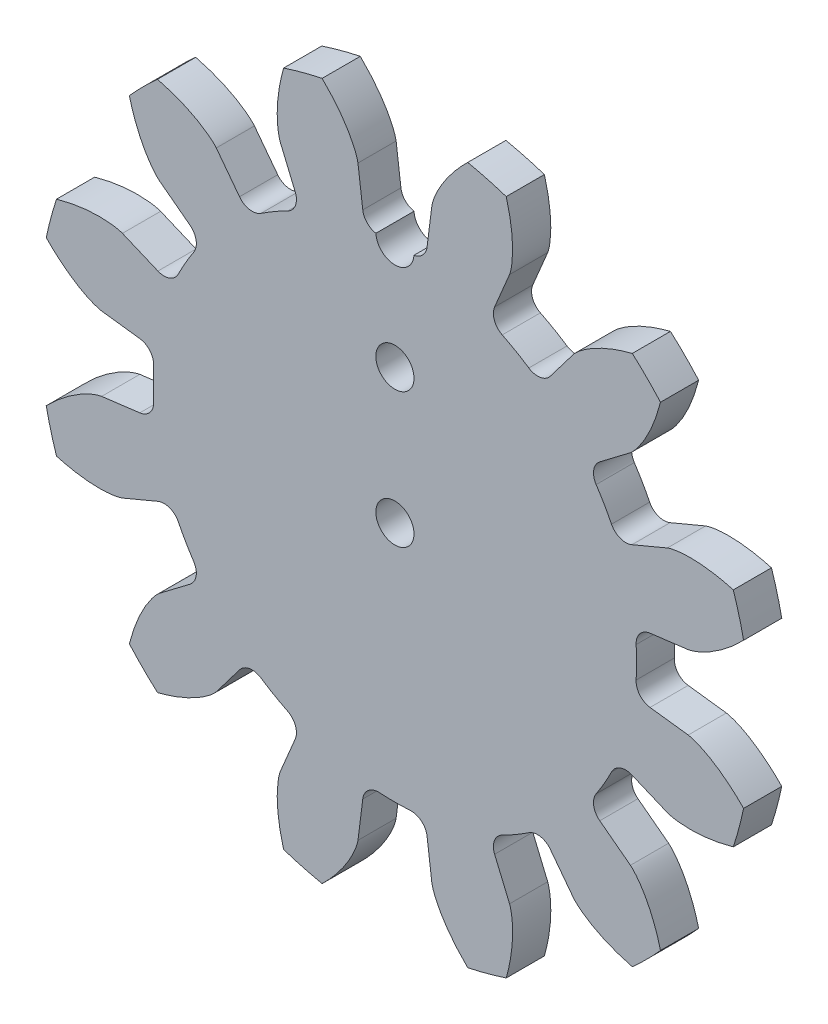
from build123d import *

# Parameters (mm, degrees)
BASECYLINDERSKETCH_R         = 29.633333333
BASECYLINDERSKETCH_R_2       = 1.5875
BASECYLINDER_DEPTH           = 3.175
TOOTH_DEPTH                  = 43.027961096
TOOTHGULLETFILLET_R          = 1.323318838
TEETH_COUNT                  = 12
TOOTHGULLETFILLET_OF_TEETH_R = 1.323318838
F_1_8_0_1250_DOWEL_HOLE1_D   = 3.175


with BuildPart() as part:
    # BaseCylinderSketch → BaseCylinder (new body)
    with BuildSketch(Plane.XY):
        Circle(BASECYLINDERSKETCH_R)
        Circle(BASECYLINDERSKETCH_R_2, mode=Mode.SUBTRACT)
    extrude(amount=BASECYLINDER_DEPTH)

    # InvoluteCurvesAndToothGulletSketch → Tooth (cut, symmetric)
    with BuildSketch(Plane.XY.offset(3.175)):
        with BuildLine():
            ThreePointArc((19.950550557, 2.51408073), (20.108333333, 0), (19.950550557, -2.51408073))
            Line((19.950550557, -2.51408073), (24.397993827, -3.074527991))
            add(Edge.make_bspline(
                [(24.397993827, -3.074527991), (24.406134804, -3.075671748), (24.428917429, -3.079238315), (24.471780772, -3.087396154), (24.541379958, -3.102709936), (24.62951992, -3.125157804), (24.742752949, -3.157528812), (24.875192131, -3.199963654), (25.019660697, -3.251083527), (25.175587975, -3.311514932), (25.329978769, -3.376042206), (25.482841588, -3.4443348), (25.634040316, -3.515890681), (25.815852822, -3.606708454), (26.031961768, -3.721349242), (26.281618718, -3.863637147), (26.561165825, -4.034742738), (26.841988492, -4.21941318), (27.114886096, -4.409544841), (27.386446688, -4.611195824), (27.646228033, -4.813063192), (27.911532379, -5.032358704), (28.154136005, -5.239686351), (28.420686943, -5.482446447), (28.634281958, -5.681431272), (28.850387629, -5.895603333), (28.954890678, -6.00110836), (29.00801009, -6.055559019)],
                knots=[0, 0, 0, 0, 0, 0.005376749, 0.015083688, 0.02853182, 0.04661014, 0.064854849, 0.092110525, 0.119476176, 0.146842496, 0.174208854, 0.201574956, 0.228941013, 0.256307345, 0.307035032, 0.361767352, 0.416499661, 0.471231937, 0.525964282, 0.580696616, 0.635428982, 0.690161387, 0.744893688, 0.799626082, 0.854358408, 0.909090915, 0.909090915, 0.909090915, 0.909090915, 0.909090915], degree=4))
            ThreePointArc((29.00801009, -6.055559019), (29.476587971, -3.043880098), (29.633333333, 0))
            ThreePointArc((29.633333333, 0), (29.476587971, 3.043880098), (29.00801009, 6.055559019))
            add(Edge.make_bspline(
                [(24.397993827, 3.074527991), (24.406134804, 3.075671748), (24.428917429, 3.079238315), (24.471780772, 3.087396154), (24.541379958, 3.102709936), (24.62951992, 3.125157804), (24.742752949, 3.157528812), (24.875192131, 3.199963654), (25.019660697, 3.251083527), (25.175587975, 3.311514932), (25.329978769, 3.376042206), (25.482841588, 3.4443348), (25.634040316, 3.515890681), (25.815852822, 3.606708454), (26.031961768, 3.721349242), (26.281618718, 3.863637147), (26.561165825, 4.034742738), (26.841988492, 4.21941318), (27.114886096, 4.409544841), (27.386446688, 4.611195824), (27.646228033, 4.813063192), (27.911532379, 5.032358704), (28.154136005, 5.239686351), (28.420686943, 5.482446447), (28.634281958, 5.681431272), (28.850387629, 5.895603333), (28.954890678, 6.00110836), (29.00801009, 6.055559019)],
                knots=[0, 0, 0, 0, 0, 0.005376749, 0.015083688, 0.02853182, 0.04661014, 0.064854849, 0.092110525, 0.119476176, 0.146842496, 0.174208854, 0.201574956, 0.228941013, 0.256307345, 0.307035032, 0.361767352, 0.416499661, 0.471231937, 0.525964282, 0.580696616, 0.635428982, 0.690161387, 0.744893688, 0.799626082, 0.854358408, 0.909090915, 0.909090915, 0.909090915, 0.909090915, 0.909090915], degree=4))
            Line((24.397993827, 3.074527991), (19.950550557, 2.51408073))
        make_face()
    tooth = extrude(amount=TOOTH_DEPTH, both=True, mode=Mode.SUBTRACT)

    # ToothGulletFillet
    toothgulletfillet_edges = [part.edges().sort_by_distance(p)[0] for p in [
        (19.950550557, 2.51408073, 1.5875),
        (19.950550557, -2.51408073, 1.5875),
    ]]
    fillet(toothgulletfillet_edges, radius=TOOTHGULLETFILLET_R)

    # Teeth: Tooth ×12 about axis
    teeth_axis = Axis((0, 0, 3.175), (0, 0, -1))
    for i in range(1, TEETH_COUNT):
        add(tooth.rotate(teeth_axis, i * 360 / TEETH_COUNT), mode=Mode.SUBTRACT)

    # ToothGulletFillet of Teeth
    toothgulletfillet_of_teeth_edges = [part.edges().sort_by_distance(p)[0] for p in [
        (18.534723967, -7.798017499, 1.5875),
        (16.020643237, -12.152533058, 1.5875),
        (12.152533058, -16.020643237, 1.5875),
        (7.798017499, -18.534723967, 1.5875),
        (2.51408073, -19.950550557, 1.5875),
        (-2.51408073, -19.950550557, 1.5875),
        (-7.798017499, -18.534723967, 1.5875),
        (-12.152533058, -16.020643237, 1.5875),
        (-16.020643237, -12.152533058, 1.5875),
        (-18.534723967, -7.798017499, 1.5875),
        (-19.950550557, -2.51408073, 1.5875),
        (-19.950550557, 2.51408073, 1.5875),
        (-18.534723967, 7.798017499, 1.5875),
        (-16.020643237, 12.152533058, 1.5875),
        (-12.152533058, 16.020643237, 1.5875),
        (-7.798017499, 18.534723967, 1.5875),
        (-2.51408073, 19.950550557, 1.5875),
        (2.51408073, 19.950550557, 1.5875),
        (7.798017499, 18.534723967, 1.5875),
        (12.152533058, 16.020643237, 1.5875),
        (16.020643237, 12.152533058, 1.5875),
        (18.534723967, 7.798017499, 1.5875),
    ]]
    fillet(toothgulletfillet_of_teeth_edges, radius=TOOTHGULLETFILLET_OF_TEETH_R)

    # 1_8 _0.1250_ Dowel Hole1 (through all)
    with Locations(Plane(origin=(0, 0, 0), x_dir=(-1, 0, 0), z_dir=(0, 0, -1))):
        with Locations((0, 11.221514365), (0, 20.179502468), (0, 31.81151687)):
            Hole(F_1_8_0_1250_DOWEL_HOLE1_D / 2)


solid = part.part
